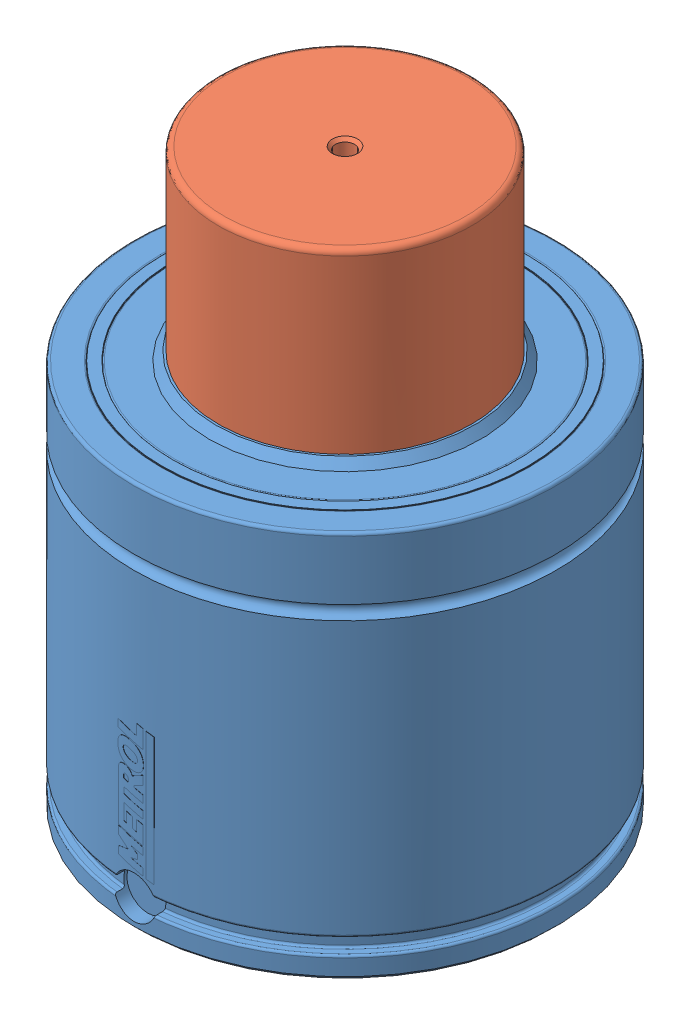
SolidWorks assembly EX9500-063.SLDASM, configuration Default (file format 7000). Lengths in mm.
Overall size (150 204 150.03).
2 component instances, 2 part files, 5 mates.
Components (placement in the parent):
- EX-9500 BODY-1: EX-9500 BODY.SLDPRT [EX-9500-063] x (0 0 1) z (0 -1 0) size (150.03 150 141)
- EX-9500 PISTON-1: EX-9500 PISTON.SLDPRT [EX-9500-063] at (0 108 0) x (0.988725 0 0.149742) z (0 -1 0) size (110 110 96)
Mates (geometry in assembly coordinates):
- Concentric1: concentric aligned: cylinder of EX-9500 BODY-1 through (0 0 0) axis (0 -1 0) radius 75; cylinder of EX-9500 PISTON-1 through (0 108 0) axis (0 -1 0) radius 45
- LimitDistance1: limit distance anti-aligned: plane of EX-9500 BODY-1 through (-45 118 0) normal (0 -1 0); plane of EX-9500 PISTON-1 through (-6.7384 118 44.4926) normal (0 1 0)
- Coincident1: coincident anti-aligned: plane of EX-9500 BODY-1 through (0 0 0) normal (0 -1 0); plane of assembly through (0 0 0) normal (0 1 0)
- Coincident2: coincident anti-aligned: plane of EX-9500 BODY-1; plane of assembly through (0 0 0) normal (1 0 0)
- Coincident3: coincident aligned: plane of EX-9500 BODY-1; plane of assembly through (0 0 0) normal (0 0 1)
